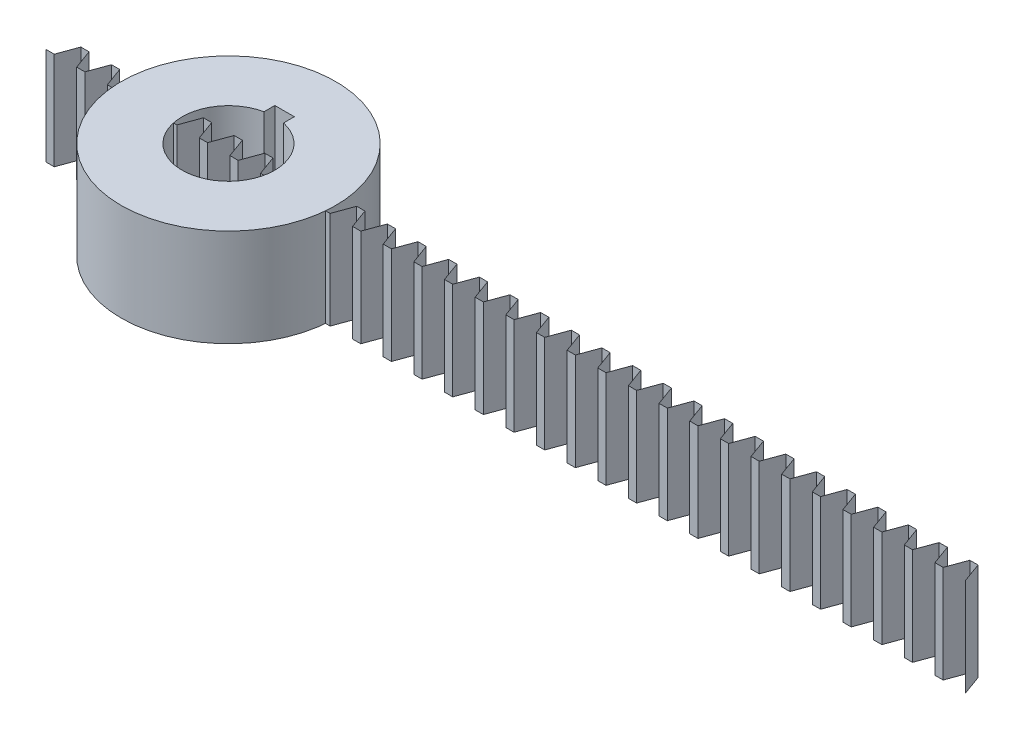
from build123d import *

# Parameters (mm, degrees)
SKIZZE1_R               = 22
LINEAR_AUSTRAGEN1_DEPTH = 20


with BuildPart() as part:
    # Skizze1 → Linear austragen1 (new body)
    with BuildSketch(Plane(origin=(0, 0, 0), x_dir=(1, 0, 0), z_dir=(0, 1, 0))):
        with Locations(Location((0, 0, 0), (0, 0, 270))):
            Circle(SKIZZE1_R)
        with BuildLine():
            Line((-2, 9.287087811), (-2, 11.5))
            Line((-2, 11.5), (2, 11.5))
            Line((2, 11.5), (2, 9.287087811))
            ThreePointArc((2, 9.287087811), (0, -9.5), (-2, 9.287087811))
        make_face(mode=Mode.SUBTRACT)
    extrude(amount=LINEAR_AUSTRAGEN1_DEPTH)


solid = part.part
